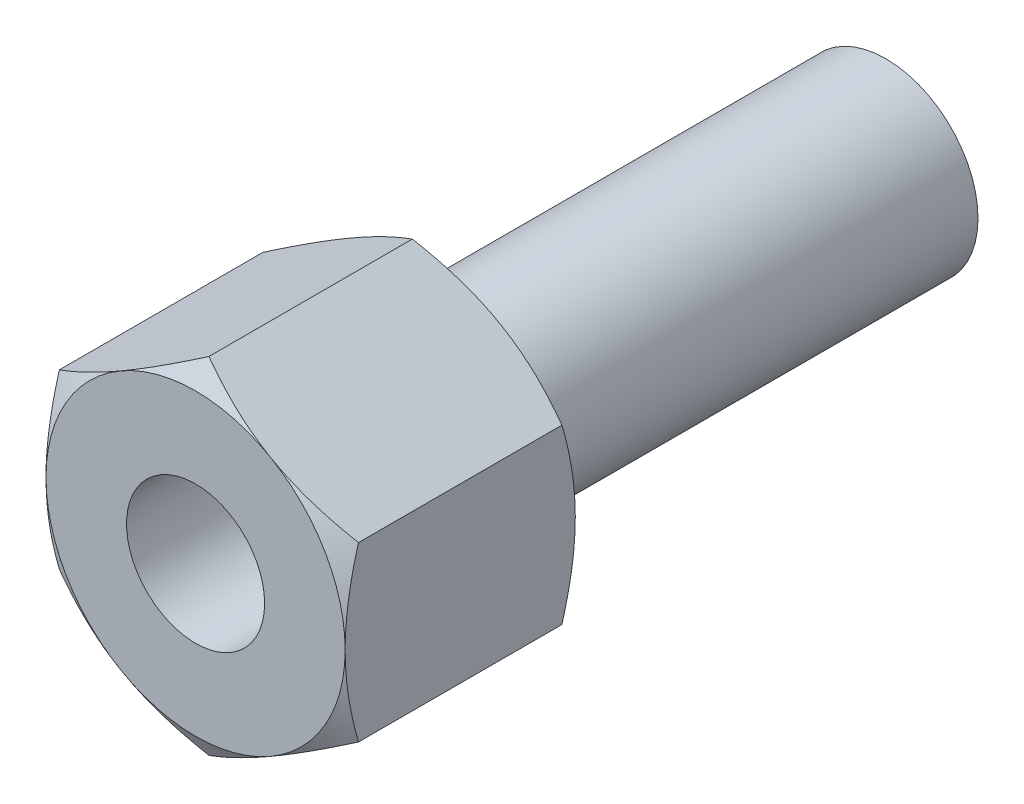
ISO-10303-21;
HEADER;
FILE_DESCRIPTION(('STEP AP214'),'2;1');
FILE_NAME('part.step','',(''),(''),'','','');
FILE_SCHEMA(('AUTOMOTIVE_DESIGN { 1 0 10303 214 1 1 1 1 }'));
ENDSEC;
DATA;
#1=APPLICATION_CONTEXT('core data for automotive mechanical design processes');
#2=APPLICATION_PROTOCOL_DEFINITION('international standard','automotive_design',2000,#1);
#3=PRODUCT_CONTEXT('',#1,'mechanical');
#4=PRODUCT('Part','Part','',(#3));
#5=PRODUCT_RELATED_PRODUCT_CATEGORY('part','',(#4));
#6=PRODUCT_DEFINITION_FORMATION('','',#4);
#7=PRODUCT_DEFINITION_CONTEXT('part definition',#1,'design');
#8=PRODUCT_DEFINITION('design','',#6,#7);
#9=PRODUCT_DEFINITION_SHAPE('','',#8);
#10=(LENGTH_UNIT() NAMED_UNIT(*) SI_UNIT(.MILLI.,.METRE.));
#11=(NAMED_UNIT(*) PLANE_ANGLE_UNIT() SI_UNIT($,.RADIAN.));
#12=(NAMED_UNIT(*) SI_UNIT($,.STERADIAN.) SOLID_ANGLE_UNIT());
#13=UNCERTAINTY_MEASURE_WITH_UNIT(LENGTH_MEASURE(1.E-05),#10,'distance_accuracy_value','');
#14=(GEOMETRIC_REPRESENTATION_CONTEXT(3) GLOBAL_UNCERTAINTY_ASSIGNED_CONTEXT((#13)) GLOBAL_UNIT_ASSIGNED_CONTEXT((#10,
#11,#12)) REPRESENTATION_CONTEXT('',''));
#15=CARTESIAN_POINT('',(0.,0.,0.));
#16=DIRECTION('',(0.,0.,1.));
#17=DIRECTION('',(1.,0.,0.));
#18=AXIS2_PLACEMENT_3D('',#15,#16,#17);
#19=CARTESIAN_POINT('',(-6.5,11.2583302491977,10.));
#20=DIRECTION('',(0.,0.,1.));
#21=DIRECTION('',(1.,0.,0.));
#22=AXIS2_PLACEMENT_3D('',#19,#20,#21);
#23=PLANE('',#22);
#24=CARTESIAN_POINT('',(0.,0.,10.));
#25=DIRECTION('',(0.,0.,1.));
#26=DIRECTION('',(1.,0.,0.));
#27=AXIS2_PLACEMENT_3D('',#24,#25,#26);
#28=CIRCLE('',#27,6.5);
#29=CARTESIAN_POINT('',(6.5,0.,10.));
#30=VERTEX_POINT('',#29);
#31=CARTESIAN_POINT('',(3.25,-5.62916512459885,10.));
#32=VERTEX_POINT('',#31);
#33=EDGE_CURVE('E322',#30,#32,#28,.F.);
#34=ORIENTED_EDGE('',*,*,#33,.F.);
#35=CARTESIAN_POINT('',(3.25,5.62916512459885,10.));
#36=VERTEX_POINT('',#35);
#37=EDGE_CURVE('E319',#36,#30,#28,.F.);
#38=ORIENTED_EDGE('',*,*,#37,.F.);
#39=CARTESIAN_POINT('',(-3.25,5.62916512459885,10.));
#40=VERTEX_POINT('',#39);
#41=EDGE_CURVE('E321',#40,#36,#28,.F.);
#42=ORIENTED_EDGE('',*,*,#41,.F.);
#43=CARTESIAN_POINT('',(0.,0.,10.));
#44=DIRECTION('',(0.,0.,-1.));
#45=DIRECTION('',(-1.,0.,0.));
#46=AXIS2_PLACEMENT_3D('',#43,#44,#45);
#47=CIRCLE('',#46,6.5);
#48=CARTESIAN_POINT('',(-6.5,0.,10.));
#49=VERTEX_POINT('',#48);
#50=EDGE_CURVE('E235',#49,#40,#47,.T.);
#51=ORIENTED_EDGE('',*,*,#50,.F.);
#52=CARTESIAN_POINT('',(-3.25,-5.62916512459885,10.));
#53=VERTEX_POINT('',#52);
#54=EDGE_CURVE('E325',#53,#49,#28,.F.);
#55=ORIENTED_EDGE('',*,*,#54,.F.);
#56=EDGE_CURVE('E327',#32,#53,#28,.F.);
#57=ORIENTED_EDGE('',*,*,#56,.F.);
#58=EDGE_LOOP('',(#34,#38,#42,#51,#55,#57));
#59=FACE_BOUND('',#58,.T.);
#60=CARTESIAN_POINT('',(0.,0.,10.));
#61=DIRECTION('',(0.,0.,1.));
#62=DIRECTION('',(1.,0.,0.));
#63=AXIS2_PLACEMENT_3D('',#60,#61,#62);
#64=CIRCLE('',#63,3.);
#65=CARTESIAN_POINT('',(3.,0.,10.));
#66=VERTEX_POINT('',#65);
#67=EDGE_CURVE('E299',#66,#66,#64,.T.);
#68=ORIENTED_EDGE('',*,*,#67,.F.);
#69=EDGE_LOOP('',(#68));
#70=FACE_BOUND('',#69,.T.);
#71=ADVANCED_FACE('F14',(#59,#70),#23,.T.);
#72=CARTESIAN_POINT('',(2.5,0.,4.));
#73=DIRECTION('',(0.,0.,-1.));
#74=DIRECTION('',(-1.,0.,0.));
#75=AXIS2_PLACEMENT_3D('',#72,#73,#74);
#76=PLANE('',#75);
#77=CARTESIAN_POINT('',(0.,0.,4.));
#78=DIRECTION('',(0.,0.,1.));
#79=DIRECTION('',(1.,0.,0.));
#80=AXIS2_PLACEMENT_3D('',#77,#78,#79);
#81=CIRCLE('',#80,3.);
#82=CARTESIAN_POINT('',(3.,0.,4.));
#83=VERTEX_POINT('',#82);
#84=EDGE_CURVE('E296',#83,#83,#81,.T.);
#85=ORIENTED_EDGE('',*,*,#84,.T.);
#86=EDGE_LOOP('',(#85));
#87=FACE_BOUND('',#86,.T.);
#88=ADVANCED_FACE('F194',(#87),#76,.F.);
#89=CARTESIAN_POINT('',(0.,0.,10.));
#90=DIRECTION('',(0.,0.,1.));
#91=DIRECTION('',(1.,0.,0.));
#92=AXIS2_PLACEMENT_3D('',#89,#90,#91);
#93=CYLINDRICAL_SURFACE('',#92,3.);
#94=ORIENTED_EDGE('',*,*,#84,.F.);
#95=EDGE_LOOP('',(#94));
#96=FACE_BOUND('',#95,.T.);
#97=ORIENTED_EDGE('',*,*,#67,.T.);
#98=EDGE_LOOP('',(#97));
#99=FACE_BOUND('',#98,.T.);
#100=ADVANCED_FACE('F280',(#96,#99),#93,.F.);
#101=CARTESIAN_POINT('',(0.,0.,10.));
#102=DIRECTION('',(0.,0.,-1.));
#103=DIRECTION('',(-1.,0.,0.));
#104=AXIS2_PLACEMENT_3D('',#101,#102,#103);
#105=CONICAL_SURFACE('',#104,6.5,1.0471975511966);
#106=ORIENTED_EDGE('',*,*,#37,.T.);
#107=CARTESIAN_POINT('',(6.5,-10.1219316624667,6.80767054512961));
#108=CARTESIAN_POINT('',(6.5,-9.83768979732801,6.94571973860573));
#109=CARTESIAN_POINT('',(6.5,-9.5527998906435,7.08245725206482));
#110=CARTESIAN_POINT('',(6.5,-8.98137955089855,7.35257206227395));
#111=CARTESIAN_POINT('',(6.5,-8.69484887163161,7.48594883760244));
#112=CARTESIAN_POINT('',(6.5,-8.11834601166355,7.74926750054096));
#113=CARTESIAN_POINT('',(6.5,-7.82836361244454,7.8791870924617));
#114=CARTESIAN_POINT('',(6.5,-7.24610694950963,8.13376497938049));
#115=CARTESIAN_POINT('',(6.5,-6.95383279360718,8.25842352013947));
#116=CARTESIAN_POINT('',(6.5,-6.35692091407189,8.5050613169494));
#117=CARTESIAN_POINT('',(6.5,-6.052191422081,8.62681967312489));
#118=CARTESIAN_POINT('',(6.5,-5.43918232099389,8.86122131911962));
#119=CARTESIAN_POINT('',(6.5,-5.13090232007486,8.97386359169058));
#120=CARTESIAN_POINT('',(6.5,-4.51086671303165,9.18710663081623));
#121=CARTESIAN_POINT('',(6.5,-4.19911945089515,9.28773142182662));
#122=CARTESIAN_POINT('',(6.5,-3.5711495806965,9.47373682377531));
#123=CARTESIAN_POINT('',(6.5,-3.25492840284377,9.55912219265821));
#124=CARTESIAN_POINT('',(6.5,-2.61961849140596,9.71012352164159));
#125=CARTESIAN_POINT('',(6.5,-2.30055613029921,9.77584867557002));
#126=CARTESIAN_POINT('',(6.5,-1.65837482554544,9.88383257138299));
#127=CARTESIAN_POINT('',(6.5,-1.33525628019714,9.92609359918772));
#128=CARTESIAN_POINT('',(6.5,-0.850972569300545,9.96908265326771));
#129=CARTESIAN_POINT('',(6.5,-0.690672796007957,9.98000539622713));
#130=CARTESIAN_POINT('',(6.5,-0.36974780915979,9.99506578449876));
#131=CARTESIAN_POINT('',(6.5,-0.209122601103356,9.99920354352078));
#132=CARTESIAN_POINT('',(6.5,0.112156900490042,10.0005876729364));
#133=CARTESIAN_POINT('',(6.5,0.272811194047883,9.99783403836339));
#134=CARTESIAN_POINT('',(6.5,0.593860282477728,9.985505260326));
#135=CARTESIAN_POINT('',(6.5,0.754255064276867,9.97592978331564));
#136=CARTESIAN_POINT('',(6.5,1.13848767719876,9.94502326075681));
#137=CARTESIAN_POINT('',(6.5,1.36207614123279,9.9205243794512));
#138=CARTESIAN_POINT('',(6.5,1.8076102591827,9.85959683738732));
#139=CARTESIAN_POINT('',(6.5,2.02955569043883,9.82316658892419));
#140=CARTESIAN_POINT('',(6.5,2.69266506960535,9.69790898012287));
#141=CARTESIAN_POINT('',(6.5,3.13085794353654,9.5931370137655));
#142=CARTESIAN_POINT('',(6.5,3.78610813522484,9.41124084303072));
#143=CARTESIAN_POINT('',(6.5,4.00655889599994,9.3456358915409));
#144=CARTESIAN_POINT('',(6.5,4.44531988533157,9.20755749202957));
#145=CARTESIAN_POINT('',(6.5,4.66363009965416,9.13508399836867));
#146=CARTESIAN_POINT('',(6.49999999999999,5.09817736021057,8.98443581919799));
#147=CARTESIAN_POINT('',(6.49999999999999,5.31441505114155,8.90626297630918));
#148=CARTESIAN_POINT('',(6.5,5.74509542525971,8.74514127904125));
#149=CARTESIAN_POINT('',(6.5,5.95953813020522,8.66219248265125));
#150=CARTESIAN_POINT('',(6.5,6.46830056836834,8.4599183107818));
#151=CARTESIAN_POINT('',(6.5,6.76189923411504,8.33878258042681));
#152=CARTESIAN_POINT('',(6.49999999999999,7.34656791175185,8.09053742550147));
#153=CARTESIAN_POINT('',(6.49999999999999,7.63763776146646,7.96342762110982));
#154=CARTESIAN_POINT('',(6.49999999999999,8.21771723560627,7.70444195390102));
#155=CARTESIAN_POINT('',(6.49999999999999,8.50672641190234,7.57256509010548));
#156=CARTESIAN_POINT('',(6.49999999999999,9.08298119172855,7.30500607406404));
#157=CARTESIAN_POINT('',(6.49999999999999,9.37022675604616,7.16932383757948));
#158=CARTESIAN_POINT('',(6.49999999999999,9.94355495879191,6.89472473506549));
#159=CARTESIAN_POINT('',(6.49999999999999,10.2296359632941,6.75580446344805));
#160=CARTESIAN_POINT('',(6.49999999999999,10.8005530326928,6.47542652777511));
#161=CARTESIAN_POINT('',(6.49999999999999,11.0853890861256,6.33396884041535));
#162=CARTESIAN_POINT('',(6.49999999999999,11.9382501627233,5.90650831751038));
#163=CARTESIAN_POINT('',(6.49999999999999,12.5047081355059,5.61737936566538));
#164=CARTESIAN_POINT('',(6.49999999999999,13.5866050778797,5.05808100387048));
#165=CARTESIAN_POINT('',(6.49999999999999,14.1022909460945,4.7883870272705));
#166=CARTESIAN_POINT('',(6.49999999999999,15.1317390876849,4.2453093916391));
#167=CARTESIAN_POINT('',(6.49999999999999,15.6455012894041,3.97192559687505));
#168=CARTESIAN_POINT('',(6.49999999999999,16.670208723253,3.42305759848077));
#169=CARTESIAN_POINT('',(6.49999999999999,17.1811577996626,3.1475805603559));
#170=CARTESIAN_POINT('',(6.49999999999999,18.2018275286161,2.59442810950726));
#171=CARTESIAN_POINT('',(6.49999999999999,18.7115482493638,2.31675282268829));
#172=CARTESIAN_POINT('',(6.5,19.2208178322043,2.03825814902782));
#173=B_SPLINE_CURVE_WITH_KNOTS('',3,(#107,#108,#109,#110,#111,#112,#113,#114,#115,#116,#117,
#118,#119,#120,#121,#122,#123,#124,#125,#126,#127,#128,#129,#130,#131,#132,#133,#134,#135,#136,
#137,#138,#139,#140,#141,#142,#143,#144,#145,#146,#147,#148,#149,#150,#151,#152,#153,#154,#155,
#156,#157,#158,#159,#160,#161,#162,#163,#164,#165,#166,#167,#168,#169,#170,#171,#172),
.UNSPECIFIED.,.F.,.F.,(4,2,2,2,2,2,2,2,2,2,2,2,2,2,2,2,2,2,2,2,2,2,2,2,2,2,2,2,2,2,2,2,4),(0.,
0.947987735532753,1.89612165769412,2.84934787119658,3.80252950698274,4.78687940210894,
5.77133898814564,6.75379634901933,7.73594643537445,8.71253575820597,9.68902992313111,
10.1709225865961,10.6528071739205,11.1346921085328,11.6166006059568,12.2910004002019,
12.9654899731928,14.3152013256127,15.0051594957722,15.6951222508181,16.3848629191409,
17.0745952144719,18.0273258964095,18.9801172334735,19.9331098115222,20.8861235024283,
21.8401892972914,22.7942638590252,24.7021463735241,26.4479829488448,28.1938839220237,
29.9353169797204,31.6766510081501),.UNSPECIFIED.);
#174=CARTESIAN_POINT('',(6.5,3.75277674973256,9.41944341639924));
#175=VERTEX_POINT('',#174);
#176=EDGE_CURVE('E222',#175,#30,#173,.F.);
#177=ORIENTED_EDGE('',*,*,#176,.F.);
#178=CARTESIAN_POINT('',(-0.000200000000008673,7.50566896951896,9.41937674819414));
#179=CARTESIAN_POINT('',(0.142677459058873,7.42317863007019,9.46699557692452));
#180=CARTESIAN_POINT('',(0.286087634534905,7.34038072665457,9.5124532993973));
#181=CARTESIAN_POINT('',(0.574072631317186,7.17411251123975,9.59845131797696));
#182=CARTESIAN_POINT('',(0.718647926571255,7.09064192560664,9.63898949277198));
#183=CARTESIAN_POINT('',(1.15468865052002,6.83889369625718,9.7524289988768));
#184=CARTESIAN_POINT('',(1.44787528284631,6.6696223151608,9.81695219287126));
#185=CARTESIAN_POINT('',(1.88662374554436,6.41631077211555,9.89261341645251));
#186=CARTESIAN_POINT('',(2.03087463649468,6.33302748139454,9.91416714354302));
#187=CARTESIAN_POINT('',(2.32002821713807,6.16608458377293,9.95030968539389));
#188=CARTESIAN_POINT('',(2.46493084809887,6.08242501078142,9.96489911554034));
#189=CARTESIAN_POINT('',(2.75498777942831,5.91496056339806,9.98674124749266));
#190=CARTESIAN_POINT('',(2.90014160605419,5.8311559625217,9.9940022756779));
#191=CARTESIAN_POINT('',(3.19057533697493,5.66347396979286,10.0010396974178));
#192=CARTESIAN_POINT('',(3.33585523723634,5.5795965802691,10.0008163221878));
#193=CARTESIAN_POINT('',(3.73387594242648,5.34979921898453,9.98991654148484));
#194=CARTESIAN_POINT('',(3.98648646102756,5.20395446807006,9.97161818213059));
#195=CARTESIAN_POINT('',(4.49002967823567,4.91323365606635,9.91359365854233));
#196=CARTESIAN_POINT('',(4.74096060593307,4.76835861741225,9.87384766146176));
#197=CARTESIAN_POINT('',(5.24551722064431,4.47705272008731,9.77449409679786));
#198=CARTESIAN_POINT('',(5.49907924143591,4.33065861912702,9.71446557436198));
#199=CARTESIAN_POINT('',(6.00242193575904,4.04005357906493,9.57822500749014));
#200=CARTESIAN_POINT('',(6.25220905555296,3.8958389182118,9.50204496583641));
#201=CARTESIAN_POINT('',(6.5002,3.75266127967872,9.41937674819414));
#202=B_SPLINE_CURVE_WITH_KNOTS('',3,(#178,#179,#180,#181,#182,#183,#184,#185,#186,#187,#188,
#189,#190,#191,#192,#193,#194,#195,#196,#197,#198,#199,#200,#201),.UNSPECIFIED.,.F.,.F.,(4,2,2,
2,2,2,2,2,2,2,2,4),(0.,0.515105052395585,1.03043143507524,2.06322554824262,2.56697389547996,
3.07067772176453,3.57380860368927,4.07692394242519,4.95279354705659,5.82947446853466,
6.72559912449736,7.61996451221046),.UNSPECIFIED.);
#203=EDGE_CURVE('E215',#36,#175,#202,.T.);
#204=ORIENTED_EDGE('',*,*,#203,.F.);
#205=EDGE_LOOP('',(#106,#177,#204));
#206=FACE_BOUND('',#205,.T.);
#207=ADVANCED_FACE('F282',(#206),#105,.T.);
#208=ORIENTED_EDGE('',*,*,#41,.T.);
#209=CARTESIAN_POINT('',(0.,7.50555349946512,9.41944341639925));
#210=VERTEX_POINT('',#209);
#211=EDGE_CURVE('E221',#210,#36,#202,.T.);
#212=ORIENTED_EDGE('',*,*,#211,.F.);
#213=CARTESIAN_POINT('',(-6.5002,3.75266127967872,9.41937674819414));
#214=CARTESIAN_POINT('',(-6.35732254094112,3.83515161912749,9.46699557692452));
#215=CARTESIAN_POINT('',(-6.21391236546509,3.91794952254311,9.5124532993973));
#216=CARTESIAN_POINT('',(-5.9259273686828,4.08421773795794,9.59845131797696));
#217=CARTESIAN_POINT('',(-5.78135207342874,4.16768832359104,9.63898949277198));
#218=CARTESIAN_POINT('',(-5.34531134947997,4.4194365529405,9.75242899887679));
#219=CARTESIAN_POINT('',(-5.05212471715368,4.58870793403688,9.81695219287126));
#220=CARTESIAN_POINT('',(-4.61337625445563,4.84201947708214,9.89261341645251));
#221=CARTESIAN_POINT('',(-4.46912536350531,4.92530276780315,9.91416714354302));
#222=CARTESIAN_POINT('',(-4.17997178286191,5.09224566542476,9.95030968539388));
#223=CARTESIAN_POINT('',(-4.03506915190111,5.17590523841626,9.96489911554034));
#224=CARTESIAN_POINT('',(-3.74501222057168,5.34336968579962,9.98674124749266));
#225=CARTESIAN_POINT('',(-3.59985839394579,5.42717428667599,9.9940022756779));
#226=CARTESIAN_POINT('',(-3.30942466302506,5.59485627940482,10.0010396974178));
#227=CARTESIAN_POINT('',(-3.16414476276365,5.67873366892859,10.0008163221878));
#228=CARTESIAN_POINT('',(-2.76612405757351,5.90853103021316,9.98991654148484));
#229=CARTESIAN_POINT('',(-2.51351353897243,6.05437578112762,9.97161818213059));
#230=CARTESIAN_POINT('',(-2.00997032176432,6.34509659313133,9.91359365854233));
#231=CARTESIAN_POINT('',(-1.75903939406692,6.48997163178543,9.87384766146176));
#232=CARTESIAN_POINT('',(-1.25448277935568,6.78127752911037,9.77449409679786));
#233=CARTESIAN_POINT('',(-1.00092075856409,6.92767163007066,9.71446557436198));
#234=CARTESIAN_POINT('',(-0.497578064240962,7.21827667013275,9.57822500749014));
#235=CARTESIAN_POINT('',(-0.247790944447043,7.36249133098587,9.50204496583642));
#236=CARTESIAN_POINT('',(0.000199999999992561,7.50566896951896,9.41937674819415));
#237=B_SPLINE_CURVE_WITH_KNOTS('',3,(#213,#214,#215,#216,#217,#218,#219,#220,#221,#222,#223,
#224,#225,#226,#227,#228,#229,#230,#231,#232,#233,#234,#235,#236),.UNSPECIFIED.,.F.,.F.,(4,2,2,
2,2,2,2,2,2,2,2,4),(0.,0.515105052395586,1.03043143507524,2.06322554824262,2.56697389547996,
3.07067772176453,3.57380860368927,4.07692394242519,4.95279354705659,5.82947446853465,
6.72559912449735,7.61996451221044),.UNSPECIFIED.);
#238=EDGE_CURVE('E175',#40,#210,#237,.T.);
#239=ORIENTED_EDGE('',*,*,#238,.F.);
#240=EDGE_LOOP('',(#208,#212,#239));
#241=FACE_BOUND('',#240,.T.);
#242=ADVANCED_FACE('F290',(#241),#105,.T.);
#243=ORIENTED_EDGE('',*,*,#50,.T.);
#244=CARTESIAN_POINT('',(-6.5,3.75277674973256,9.41944341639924));
#245=VERTEX_POINT('',#244);
#246=EDGE_CURVE('E174',#245,#40,#237,.T.);
#247=ORIENTED_EDGE('',*,*,#246,.F.);
#248=CARTESIAN_POINT('',(-6.5,-10.1219316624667,6.8076705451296));
#249=CARTESIAN_POINT('',(-6.5,-9.83768979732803,6.94571973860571));
#250=CARTESIAN_POINT('',(-6.50000000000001,-9.55279989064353,7.08245725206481));
#251=CARTESIAN_POINT('',(-6.50000000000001,-8.98137955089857,7.35257206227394));
#252=CARTESIAN_POINT('',(-6.50000000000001,-8.69484887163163,7.48594883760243));
#253=CARTESIAN_POINT('',(-6.50000000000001,-8.11834601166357,7.74926750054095));
#254=CARTESIAN_POINT('',(-6.50000000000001,-7.82836361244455,7.87918709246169));
#255=CARTESIAN_POINT('',(-6.50000000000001,-7.24610694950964,8.13376497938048));
#256=CARTESIAN_POINT('',(-6.50000000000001,-6.9538327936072,8.25842352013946));
#257=CARTESIAN_POINT('',(-6.50000000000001,-6.35692091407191,8.50506131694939));
#258=CARTESIAN_POINT('',(-6.5,-6.05219142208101,8.62681967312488));
#259=CARTESIAN_POINT('',(-6.5,-5.43918232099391,8.86122131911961));
#260=CARTESIAN_POINT('',(-6.5,-5.13090232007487,8.97386359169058));
#261=CARTESIAN_POINT('',(-6.5,-4.51086671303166,9.18710663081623));
#262=CARTESIAN_POINT('',(-6.5,-4.19911945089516,9.28773142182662));
#263=CARTESIAN_POINT('',(-6.5,-3.57114958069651,9.4737368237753));
#264=CARTESIAN_POINT('',(-6.5,-3.25492840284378,9.5591221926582));
#265=CARTESIAN_POINT('',(-6.5,-2.61961849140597,9.71012352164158));
#266=CARTESIAN_POINT('',(-6.5,-2.30055613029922,9.77584867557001));
#267=CARTESIAN_POINT('',(-6.5,-1.65837482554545,9.88383257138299));
#268=CARTESIAN_POINT('',(-6.5,-1.33525628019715,9.92609359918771));
#269=CARTESIAN_POINT('',(-6.5,-0.850972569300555,9.96908265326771));
#270=CARTESIAN_POINT('',(-6.5,-0.690672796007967,9.98000539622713));
#271=CARTESIAN_POINT('',(-6.5,-0.3697478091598,9.99506578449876));
#272=CARTESIAN_POINT('',(-6.5,-0.209122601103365,9.99920354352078));
#273=CARTESIAN_POINT('',(-6.5,0.112156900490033,10.0005876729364));
#274=CARTESIAN_POINT('',(-6.5,0.272811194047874,9.99783403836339));
#275=CARTESIAN_POINT('',(-6.5,0.59386028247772,9.98550526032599));
#276=CARTESIAN_POINT('',(-6.5,0.754255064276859,9.97592978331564));
#277=CARTESIAN_POINT('',(-6.5,1.13848767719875,9.94502326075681));
#278=CARTESIAN_POINT('',(-6.5,1.36207614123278,9.9205243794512));
#279=CARTESIAN_POINT('',(-6.5,1.80761025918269,9.85959683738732));
#280=CARTESIAN_POINT('',(-6.5,2.02955569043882,9.82316658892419));
#281=CARTESIAN_POINT('',(-6.5,2.69266506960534,9.69790898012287));
#282=CARTESIAN_POINT('',(-6.5,3.13085794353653,9.5931370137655));
#283=CARTESIAN_POINT('',(-6.5,3.78610813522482,9.41124084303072));
#284=CARTESIAN_POINT('',(-6.5,4.00655889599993,9.3456358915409));
#285=CARTESIAN_POINT('',(-6.5,4.44531988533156,9.20755749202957));
#286=CARTESIAN_POINT('',(-6.5,4.66363009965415,9.13508399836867));
#287=CARTESIAN_POINT('',(-6.5,5.09817736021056,8.98443581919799));
#288=CARTESIAN_POINT('',(-6.5,5.31441505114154,8.90626297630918));
#289=CARTESIAN_POINT('',(-6.5,5.7450954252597,8.74514127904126));
#290=CARTESIAN_POINT('',(-6.5,5.95953813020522,8.66219248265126));
#291=CARTESIAN_POINT('',(-6.5,6.46830056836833,8.45991831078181));
#292=CARTESIAN_POINT('',(-6.5,6.76189923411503,8.33878258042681));
#293=CARTESIAN_POINT('',(-6.5,7.34656791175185,8.09053742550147));
#294=CARTESIAN_POINT('',(-6.5,7.63763776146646,7.96342762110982));
#295=CARTESIAN_POINT('',(-6.5,8.21771723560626,7.70444195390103));
#296=CARTESIAN_POINT('',(-6.5,8.50672641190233,7.57256509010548));
#297=CARTESIAN_POINT('',(-6.5,9.08298119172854,7.30500607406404));
#298=CARTESIAN_POINT('',(-6.5,9.37022675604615,7.16932383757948));
#299=CARTESIAN_POINT('',(-6.5,9.94355495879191,6.89472473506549));
#300=CARTESIAN_POINT('',(-6.5,10.2296359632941,6.75580446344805));
#301=CARTESIAN_POINT('',(-6.5,10.8005530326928,6.47542652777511));
#302=CARTESIAN_POINT('',(-6.5,11.0853890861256,6.33396884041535));
#303=CARTESIAN_POINT('',(-6.5,11.9382501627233,5.90650831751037));
#304=CARTESIAN_POINT('',(-6.5,12.5047081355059,5.61737936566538));
#305=CARTESIAN_POINT('',(-6.5,13.5866050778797,5.05808100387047));
#306=CARTESIAN_POINT('',(-6.49999999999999,14.1022909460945,4.78838702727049));
#307=CARTESIAN_POINT('',(-6.49999999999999,15.1317390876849,4.2453093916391));
#308=CARTESIAN_POINT('',(-6.49999999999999,15.6455012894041,3.97192559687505));
#309=CARTESIAN_POINT('',(-6.49999999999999,16.670208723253,3.42305759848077));
#310=CARTESIAN_POINT('',(-6.49999999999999,17.1811577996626,3.1475805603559));
#311=CARTESIAN_POINT('',(-6.49999999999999,18.2018275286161,2.59442810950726));
#312=CARTESIAN_POINT('',(-6.5,18.7115482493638,2.31675282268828));
#313=CARTESIAN_POINT('',(-6.5,19.2208178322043,2.03825814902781));
#314=B_SPLINE_CURVE_WITH_KNOTS('',3,(#248,#249,#250,#251,#252,#253,#254,#255,#256,#257,#258,
#259,#260,#261,#262,#263,#264,#265,#266,#267,#268,#269,#270,#271,#272,#273,#274,#275,#276,#277,
#278,#279,#280,#281,#282,#283,#284,#285,#286,#287,#288,#289,#290,#291,#292,#293,#294,#295,#296,
#297,#298,#299,#300,#301,#302,#303,#304,#305,#306,#307,#308,#309,#310,#311,#312,#313),
.UNSPECIFIED.,.F.,.F.,(4,2,2,2,2,2,2,2,2,2,2,2,2,2,2,2,2,2,2,2,2,2,2,2,2,2,2,2,2,2,2,2,4),(0.,
0.947987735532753,1.89612165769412,2.84934787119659,3.80252950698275,4.78687940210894,
5.77133898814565,6.75379634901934,7.73594643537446,8.71253575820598,9.68902992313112,
10.1709225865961,10.6528071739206,11.1346921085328,11.6166006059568,12.2910004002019,
12.9654899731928,14.3152013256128,15.0051594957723,15.6951222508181,16.3848629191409,
17.0745952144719,18.0273258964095,18.9801172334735,19.9331098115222,20.8861235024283,
21.8401892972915,22.7942638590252,24.7021463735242,26.4479829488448,28.1938839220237,
29.9353169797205,31.6766510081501),.UNSPECIFIED.);
#315=EDGE_CURVE('E166',#49,#245,#314,.T.);
#316=ORIENTED_EDGE('',*,*,#315,.F.);
#317=EDGE_LOOP('',(#243,#247,#316));
#318=FACE_BOUND('',#317,.T.);
#319=ADVANCED_FACE('F438',(#318),#105,.T.);
#320=ORIENTED_EDGE('',*,*,#54,.T.);
#321=CARTESIAN_POINT('',(-6.5,-3.75277674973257,9.41944341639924));
#322=VERTEX_POINT('',#321);
#323=EDGE_CURVE('E173',#322,#49,#314,.T.);
#324=ORIENTED_EDGE('',*,*,#323,.F.);
#325=CARTESIAN_POINT('',(0.000200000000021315,-7.50566896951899,9.41937674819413));
#326=CARTESIAN_POINT('',(-0.142677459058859,-7.42317863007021,9.46699557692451));
#327=CARTESIAN_POINT('',(-0.286087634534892,-7.34038072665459,9.51245329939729));
#328=CARTESIAN_POINT('',(-0.574072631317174,-7.17411251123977,9.59845131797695));
#329=CARTESIAN_POINT('',(-0.718647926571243,-7.09064192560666,9.63898949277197));
#330=CARTESIAN_POINT('',(-1.15468865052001,-6.8388936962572,9.75242899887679));
#331=CARTESIAN_POINT('',(-1.4478752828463,-6.66962231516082,9.81695219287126));
#332=CARTESIAN_POINT('',(-1.88662374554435,-6.41631077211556,9.8926134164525));
#333=CARTESIAN_POINT('',(-2.03087463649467,-6.33302748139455,9.91416714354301));
#334=CARTESIAN_POINT('',(-2.32002821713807,-6.16608458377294,9.95030968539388));
#335=CARTESIAN_POINT('',(-2.46493084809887,-6.08242501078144,9.96489911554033));
#336=CARTESIAN_POINT('',(-2.7549877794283,-5.91496056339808,9.98674124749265));
#337=CARTESIAN_POINT('',(-2.90014160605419,-5.83115596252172,9.99400227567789));
#338=CARTESIAN_POINT('',(-3.19057533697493,-5.66347396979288,10.0010396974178));
#339=CARTESIAN_POINT('',(-3.33585523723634,-5.57959658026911,10.0008163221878));
#340=CARTESIAN_POINT('',(-3.73387594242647,-5.34979921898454,9.98991654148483));
#341=CARTESIAN_POINT('',(-3.98648646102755,-5.20395446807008,9.97161818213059));
#342=CARTESIAN_POINT('',(-4.49002967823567,-4.91323365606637,9.91359365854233));
#343=CARTESIAN_POINT('',(-4.74096060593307,-4.76835861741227,9.87384766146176));
#344=CARTESIAN_POINT('',(-5.24551722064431,-4.47705272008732,9.77449409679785));
#345=CARTESIAN_POINT('',(-5.49907924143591,-4.33065861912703,9.71446557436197));
#346=CARTESIAN_POINT('',(-6.00242193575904,-4.04005357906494,9.57822500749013));
#347=CARTESIAN_POINT('',(-6.25220905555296,-3.89583891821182,9.50204496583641));
#348=CARTESIAN_POINT('',(-6.5002,-3.75266127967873,9.41937674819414));
#349=B_SPLINE_CURVE_WITH_KNOTS('',3,(#325,#326,#327,#328,#329,#330,#331,#332,#333,#334,#335,
#336,#337,#338,#339,#340,#341,#342,#343,#344,#345,#346,#347,#348),.UNSPECIFIED.,.F.,.F.,(4,2,2,
2,2,2,2,2,2,2,2,4),(0.,0.515105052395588,1.03043143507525,2.06322554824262,2.56697389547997,
3.07067772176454,3.57380860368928,4.0769239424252,4.95279354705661,5.82947446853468,
6.72559912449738,7.61996451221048),.UNSPECIFIED.);
#350=EDGE_CURVE('E181',#53,#322,#349,.T.);
#351=ORIENTED_EDGE('',*,*,#350,.F.);
#352=EDGE_LOOP('',(#320,#324,#351));
#353=FACE_BOUND('',#352,.T.);
#354=ADVANCED_FACE('F192',(#353),#105,.T.);
#355=CARTESIAN_POINT('',(6.5002,-3.75266127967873,9.41937674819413));
#356=CARTESIAN_POINT('',(6.35732254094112,-3.83515161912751,9.46699557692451));
#357=CARTESIAN_POINT('',(6.21391236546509,-3.91794952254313,9.51245329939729));
#358=CARTESIAN_POINT('',(5.9259273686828,-4.08421773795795,9.59845131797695));
#359=CARTESIAN_POINT('',(5.78135207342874,-4.16768832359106,9.63898949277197));
#360=CARTESIAN_POINT('',(5.34531134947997,-4.41943655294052,9.75242899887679));
#361=CARTESIAN_POINT('',(5.05212471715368,-4.5887079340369,9.81695219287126));
#362=CARTESIAN_POINT('',(4.61337625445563,-4.84201947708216,9.89261341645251));
#363=CARTESIAN_POINT('',(4.46912536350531,-4.92530276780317,9.91416714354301));
#364=CARTESIAN_POINT('',(4.17997178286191,-5.09224566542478,9.95030968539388));
#365=CARTESIAN_POINT('',(4.03506915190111,-5.17590523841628,9.96489911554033));
#366=CARTESIAN_POINT('',(3.74501222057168,-5.34336968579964,9.98674124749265));
#367=CARTESIAN_POINT('',(3.59985839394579,-5.427174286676,9.99400227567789));
#368=CARTESIAN_POINT('',(3.30942466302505,-5.59485627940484,10.0010396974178));
#369=CARTESIAN_POINT('',(3.16414476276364,-5.67873366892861,10.0008163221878));
#370=CARTESIAN_POINT('',(2.76612405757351,-5.90853103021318,9.98991654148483));
#371=CARTESIAN_POINT('',(2.51351353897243,-6.05437578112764,9.97161818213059));
#372=CARTESIAN_POINT('',(2.00997032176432,-6.34509659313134,9.91359365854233));
#373=CARTESIAN_POINT('',(1.75903939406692,-6.48997163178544,9.87384766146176));
#374=CARTESIAN_POINT('',(1.25448277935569,-6.78127752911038,9.77449409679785));
#375=CARTESIAN_POINT('',(1.0009207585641,-6.92767163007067,9.71446557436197));
#376=CARTESIAN_POINT('',(0.497578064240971,-7.21827667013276,9.57822500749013));
#377=CARTESIAN_POINT('',(0.247790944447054,-7.36249133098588,9.50204496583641));
#378=CARTESIAN_POINT('',(-0.000199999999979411,-7.50566896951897,9.41937674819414));
#379=B_SPLINE_CURVE_WITH_KNOTS('',3,(#355,#356,#357,#358,#359,#360,#361,#362,#363,#364,#365,
#366,#367,#368,#369,#370,#371,#372,#373,#374,#375,#376,#377,#378),.UNSPECIFIED.,.F.,.F.,(4,2,2,
2,2,2,2,2,2,2,2,4),(0.,0.515105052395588,1.03043143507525,2.06322554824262,2.56697389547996,
3.07067772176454,3.57380860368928,4.0769239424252,4.9527935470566,5.82947446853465,
6.72559912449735,7.61996451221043),.UNSPECIFIED.);
#380=CARTESIAN_POINT('',(0.,-7.50555349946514,9.41944341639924));
#381=VERTEX_POINT('',#380);
#382=EDGE_CURVE('E199',#32,#381,#379,.T.);
#383=ORIENTED_EDGE('',*,*,#382,.F.);
#384=ORIENTED_EDGE('',*,*,#56,.T.);
#385=EDGE_CURVE('E339',#381,#53,#349,.T.);
#386=ORIENTED_EDGE('',*,*,#385,.F.);
#387=EDGE_LOOP('',(#383,#384,#386));
#388=FACE_BOUND('',#387,.T.);
#389=ADVANCED_FACE('F187',(#388),#105,.T.);
#390=ORIENTED_EDGE('',*,*,#33,.T.);
#391=CARTESIAN_POINT('',(6.5,-3.75277674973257,9.41944341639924));
#392=VERTEX_POINT('',#391);
#393=EDGE_CURVE('E230',#392,#32,#379,.T.);
#394=ORIENTED_EDGE('',*,*,#393,.F.);
#395=EDGE_CURVE('E208',#30,#392,#173,.F.);
#396=ORIENTED_EDGE('',*,*,#395,.F.);
#397=EDGE_LOOP('',(#390,#394,#396));
#398=FACE_BOUND('',#397,.T.);
#399=ADVANCED_FACE('F191',(#398),#105,.T.);
#400=CARTESIAN_POINT('',(0.,-7.50555349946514,10.));
#401=DIRECTION('',(-0.5,0.866025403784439,0.));
#402=DIRECTION('',(-0.866025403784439,-0.5,0.));
#403=AXIS2_PLACEMENT_3D('',#400,#401,#402);
#404=PLANE('',#403);
#405=DIRECTION('',(0.,0.,-1.));
#406=VECTOR('',#405,1.);
#407=CARTESIAN_POINT('',(0.,-7.50555349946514,10.));
#408=LINE('',#407,#406);
#409=CARTESIAN_POINT('',(0.,-7.50555349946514,0.580556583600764));
#410=VERTEX_POINT('',#409);
#411=EDGE_CURVE('E312',#381,#410,#408,.T.);
#412=ORIENTED_EDGE('',*,*,#411,.T.);
#413=CARTESIAN_POINT('',(-0.000199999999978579,-7.50566896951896,0.58062325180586));
#414=CARTESIAN_POINT('',(0.142677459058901,-7.42317863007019,0.533004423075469));
#415=CARTESIAN_POINT('',(0.286087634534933,-7.34038072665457,0.487546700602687));
#416=CARTESIAN_POINT('',(0.574072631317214,-7.17411251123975,0.401548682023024));
#417=CARTESIAN_POINT('',(0.718647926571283,-7.09064192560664,0.361010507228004));
#418=CARTESIAN_POINT('',(1.15468865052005,-6.83889369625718,0.24757100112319));
#419=CARTESIAN_POINT('',(1.44787528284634,-6.6696223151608,0.183047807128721));
#420=CARTESIAN_POINT('',(1.88662374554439,-6.41631077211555,0.107386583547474));
#421=CARTESIAN_POINT('',(2.0308746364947,-6.33302748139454,0.08583285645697));
#422=CARTESIAN_POINT('',(2.3200282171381,-6.16608458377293,0.0496903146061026));
#423=CARTESIAN_POINT('',(2.4649308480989,-6.08242501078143,0.0351008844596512));
#424=CARTESIAN_POINT('',(2.75498777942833,-5.91496056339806,0.0132587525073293));
#425=CARTESIAN_POINT('',(2.90014160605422,-5.8311559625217,0.00599772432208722));
#426=CARTESIAN_POINT('',(3.19057533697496,-5.66347396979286,-0.00103969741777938));
#427=CARTESIAN_POINT('',(3.33585523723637,-5.5795965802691,-0.000816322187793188));
#428=CARTESIAN_POINT('',(3.73387594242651,-5.34979921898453,0.0100834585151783));
#429=CARTESIAN_POINT('',(3.98648646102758,-5.20395446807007,0.0283818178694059));
#430=CARTESIAN_POINT('',(4.49002967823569,-4.91323365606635,0.0864063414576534));
#431=CARTESIAN_POINT('',(4.74096060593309,-4.76835861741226,0.126152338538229));
#432=CARTESIAN_POINT('',(5.24551722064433,-4.47705272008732,0.225505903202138));
#433=CARTESIAN_POINT('',(5.49907924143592,-4.33065861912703,0.285534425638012));
#434=CARTESIAN_POINT('',(6.00242193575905,-4.04005357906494,0.421774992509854));
#435=CARTESIAN_POINT('',(6.25220905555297,-3.89583891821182,0.497955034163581));
#436=CARTESIAN_POINT('',(6.5002,-3.75266127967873,0.580623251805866));
#437=B_SPLINE_CURVE_WITH_KNOTS('',3,(#413,#414,#415,#416,#417,#418,#419,#420,#421,#422,#423,
#424,#425,#426,#427,#428,#429,#430,#431,#432,#433,#434,#435,#436),.UNSPECIFIED.,.F.,.F.,(4,2,2,
2,2,2,2,2,2,2,2,4),(0.,0.515105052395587,1.03043143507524,2.06322554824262,2.56697389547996,
3.07067772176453,3.57380860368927,4.07692394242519,4.95279354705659,5.82947446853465,
6.72559912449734,7.61996451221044),.UNSPECIFIED.);
#438=CARTESIAN_POINT('',(3.25,-5.62916512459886,0.));
#439=VERTEX_POINT('',#438);
#440=EDGE_CURVE('E239',#410,#439,#437,.T.);
#441=ORIENTED_EDGE('',*,*,#440,.T.);
#442=CARTESIAN_POINT('',(6.5,-3.75277674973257,0.580556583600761));
#443=VERTEX_POINT('',#442);
#444=EDGE_CURVE('E244',#439,#443,#437,.T.);
#445=ORIENTED_EDGE('',*,*,#444,.T.);
#446=DIRECTION('',(0.,0.,-1.));
#447=VECTOR('',#446,1.);
#448=CARTESIAN_POINT('',(6.5,-3.75277674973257,10.));
#449=LINE('',#448,#447);
#450=EDGE_CURVE('E310',#392,#443,#449,.T.);
#451=ORIENTED_EDGE('',*,*,#450,.F.);
#452=ORIENTED_EDGE('',*,*,#393,.T.);
#453=ORIENTED_EDGE('',*,*,#382,.T.);
#454=EDGE_LOOP('',(#412,#441,#445,#451,#452,#453));
#455=FACE_BOUND('',#454,.T.);
#456=ADVANCED_FACE('F257',(#455),#404,.F.);
#457=CARTESIAN_POINT('',(6.5,-3.75277674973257,10.));
#458=DIRECTION('',(-1.,0.,0.));
#459=DIRECTION('',(0.,-1.,0.));
#460=AXIS2_PLACEMENT_3D('',#457,#458,#459);
#461=PLANE('',#460);
#462=ORIENTED_EDGE('',*,*,#450,.T.);
#463=CARTESIAN_POINT('',(6.5,-10.1219316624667,3.1923294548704));
#464=CARTESIAN_POINT('',(6.5,-9.83768979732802,3.05428026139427));
#465=CARTESIAN_POINT('',(6.5,-9.55279989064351,2.91754274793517));
#466=CARTESIAN_POINT('',(6.5,-8.98137955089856,2.64742793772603));
#467=CARTESIAN_POINT('',(6.5,-8.69484887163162,2.51405116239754));
#468=CARTESIAN_POINT('',(6.5,-8.11834601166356,2.25073249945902));
#469=CARTESIAN_POINT('',(6.5,-7.82836361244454,2.12081290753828));
#470=CARTESIAN_POINT('',(6.5,-7.24610694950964,1.8662350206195));
#471=CARTESIAN_POINT('',(6.5,-6.95383279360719,1.74157647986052));
#472=CARTESIAN_POINT('',(6.5,-6.3569209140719,1.49493868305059));
#473=CARTESIAN_POINT('',(6.5,-6.05219142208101,1.3731803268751));
#474=CARTESIAN_POINT('',(6.5,-5.4391823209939,1.13877868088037));
#475=CARTESIAN_POINT('',(6.5,-5.13090232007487,1.0261364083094));
#476=CARTESIAN_POINT('',(6.5,-4.51086671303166,0.812893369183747));
#477=CARTESIAN_POINT('',(6.5,-4.19911945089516,0.712268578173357));
#478=CARTESIAN_POINT('',(6.5,-3.5711495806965,0.526263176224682));
#479=CARTESIAN_POINT('',(6.5,-3.25492840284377,0.440877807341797));
#480=CARTESIAN_POINT('',(6.5,-2.61961849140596,0.289876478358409));
#481=CARTESIAN_POINT('',(6.5,-2.30055613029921,0.224151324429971));
#482=CARTESIAN_POINT('',(6.5,-1.65837482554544,0.116167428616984));
#483=CARTESIAN_POINT('',(6.5,-1.33525628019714,0.0739064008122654));
#484=CARTESIAN_POINT('',(6.5,-0.850972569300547,0.030917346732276));
#485=CARTESIAN_POINT('',(6.5,-0.690672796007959,0.0199946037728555));
#486=CARTESIAN_POINT('',(6.5,-0.369747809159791,0.00493421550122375));
#487=CARTESIAN_POINT('',(6.5,-0.209122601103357,0.000796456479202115));
#488=CARTESIAN_POINT('',(6.5,0.112156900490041,-0.000587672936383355));
#489=CARTESIAN_POINT('',(6.5,0.272811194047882,0.00216596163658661));
#490=CARTESIAN_POINT('',(6.5,0.593860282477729,0.0144947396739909));
#491=CARTESIAN_POINT('',(6.5,0.754255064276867,0.0240702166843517));
#492=CARTESIAN_POINT('',(6.5,1.13848767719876,0.0549767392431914));
#493=CARTESIAN_POINT('',(6.5,1.36207614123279,0.0794756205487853));
#494=CARTESIAN_POINT('',(6.5,1.80761025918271,0.140403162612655));
#495=CARTESIAN_POINT('',(6.5,2.02955569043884,0.176833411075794));
#496=CARTESIAN_POINT('',(6.5,2.69266506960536,0.302091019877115));
#497=CARTESIAN_POINT('',(6.5,3.13085794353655,0.406862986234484));
#498=CARTESIAN_POINT('',(6.5,3.78610813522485,0.588759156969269));
#499=CARTESIAN_POINT('',(6.5,4.00655889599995,0.654364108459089));
#500=CARTESIAN_POINT('',(6.5,4.44531988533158,0.792442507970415));
#501=CARTESIAN_POINT('',(6.5,4.66363009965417,0.864916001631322));
#502=CARTESIAN_POINT('',(6.49999999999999,5.09817736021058,1.015564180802));
#503=CARTESIAN_POINT('',(6.49999999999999,5.31441505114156,1.0937370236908));
#504=CARTESIAN_POINT('',(6.5,5.74509542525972,1.25485872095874));
#505=CARTESIAN_POINT('',(6.5,5.95953813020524,1.33780751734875));
#506=CARTESIAN_POINT('',(6.5,6.46830056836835,1.54008168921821));
#507=CARTESIAN_POINT('',(6.5,6.76189923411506,1.66121741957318));
#508=CARTESIAN_POINT('',(6.49999999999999,7.34656791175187,1.90946257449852));
#509=CARTESIAN_POINT('',(6.49999999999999,7.63763776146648,2.03657237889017));
#510=CARTESIAN_POINT('',(6.49999999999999,8.21771723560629,2.29555804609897));
#511=CARTESIAN_POINT('',(6.49999999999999,8.50672641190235,2.42743490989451));
#512=CARTESIAN_POINT('',(6.49999999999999,9.08298119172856,2.69499392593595));
#513=CARTESIAN_POINT('',(6.49999999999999,9.37022675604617,2.83067616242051));
#514=CARTESIAN_POINT('',(6.49999999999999,9.94355495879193,3.1052752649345));
#515=CARTESIAN_POINT('',(6.49999999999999,10.2296359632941,3.24419553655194));
#516=CARTESIAN_POINT('',(6.49999999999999,10.8005530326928,3.52457347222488));
#517=CARTESIAN_POINT('',(6.49999999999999,11.0853890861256,3.66603115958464));
#518=CARTESIAN_POINT('',(6.49999999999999,11.9382501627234,4.09349168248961));
#519=CARTESIAN_POINT('',(6.49999999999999,12.5047081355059,4.38262063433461));
#520=CARTESIAN_POINT('',(6.49999999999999,13.5866050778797,4.94191899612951));
#521=CARTESIAN_POINT('',(6.49999999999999,14.1022909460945,5.21161297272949));
#522=CARTESIAN_POINT('',(6.49999999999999,15.1317390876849,5.75469060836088));
#523=CARTESIAN_POINT('',(6.49999999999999,15.6455012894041,6.02807440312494));
#524=CARTESIAN_POINT('',(6.49999999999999,16.670208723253,6.57694240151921));
#525=CARTESIAN_POINT('',(6.49999999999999,17.1811577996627,6.85241943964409));
#526=CARTESIAN_POINT('',(6.49999999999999,18.2018275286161,7.40557189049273));
#527=CARTESIAN_POINT('',(6.49999999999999,18.7115482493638,7.68324717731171));
#528=CARTESIAN_POINT('',(6.5,19.2208178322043,7.96174185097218));
#529=B_SPLINE_CURVE_WITH_KNOTS('',3,(#463,#464,#465,#466,#467,#468,#469,#470,#471,#472,#473,
#474,#475,#476,#477,#478,#479,#480,#481,#482,#483,#484,#485,#486,#487,#488,#489,#490,#491,#492,
#493,#494,#495,#496,#497,#498,#499,#500,#501,#502,#503,#504,#505,#506,#507,#508,#509,#510,#511,
#512,#513,#514,#515,#516,#517,#518,#519,#520,#521,#522,#523,#524,#525,#526,#527,#528),
.UNSPECIFIED.,.F.,.F.,(4,2,2,2,2,2,2,2,2,2,2,2,2,2,2,2,2,2,2,2,2,2,2,2,2,2,2,2,2,2,2,2,4),(0.,
0.947987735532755,1.89612165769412,2.84934787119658,3.80252950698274,4.78687940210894,
5.77133898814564,6.75379634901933,7.73594643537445,8.71253575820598,9.68902992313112,
10.1709225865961,10.6528071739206,11.1346921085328,11.6166006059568,12.2910004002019,
12.9654899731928,14.3152013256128,15.0051594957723,15.6951222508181,16.384862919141,
17.074595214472,18.0273258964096,18.9801172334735,19.9331098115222,20.8861235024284,
21.8401892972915,22.7942638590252,24.7021463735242,26.4479829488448,28.1938839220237,
29.9353169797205,31.6766510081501),.UNSPECIFIED.);
#530=CARTESIAN_POINT('',(6.5,0.,0.));
#531=VERTEX_POINT('',#530);
#532=EDGE_CURVE('E44',#443,#531,#529,.T.);
#533=ORIENTED_EDGE('',*,*,#532,.T.);
#534=CARTESIAN_POINT('',(6.5,3.75277674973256,0.580556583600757));
#535=VERTEX_POINT('',#534);
#536=EDGE_CURVE('E252',#531,#535,#529,.T.);
#537=ORIENTED_EDGE('',*,*,#536,.T.);
#538=DIRECTION('',(0.,0.,-1.));
#539=VECTOR('',#538,1.);
#540=CARTESIAN_POINT('',(6.5,3.75277674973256,10.));
#541=LINE('',#540,#539);
#542=EDGE_CURVE('E303',#175,#535,#541,.T.);
#543=ORIENTED_EDGE('',*,*,#542,.F.);
#544=ORIENTED_EDGE('',*,*,#176,.T.);
#545=ORIENTED_EDGE('',*,*,#395,.T.);
#546=EDGE_LOOP('',(#462,#533,#537,#543,#544,#545));
#547=FACE_BOUND('',#546,.T.);
#548=ADVANCED_FACE('F260',(#547),#461,.F.);
#549=CARTESIAN_POINT('',(6.5,3.75277674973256,10.));
#550=DIRECTION('',(-0.5,-0.866025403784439,0.));
#551=DIRECTION('',(0.866025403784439,-0.5,0.));
#552=AXIS2_PLACEMENT_3D('',#549,#550,#551);
#553=PLANE('',#552);
#554=ORIENTED_EDGE('',*,*,#542,.T.);
#555=CARTESIAN_POINT('',(6.5002,3.75266127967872,0.580623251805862));
#556=CARTESIAN_POINT('',(6.35732254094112,3.83515161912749,0.533004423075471));
#557=CARTESIAN_POINT('',(6.21391236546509,3.91794952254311,0.487546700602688));
#558=CARTESIAN_POINT('',(5.92592736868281,4.08421773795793,0.401548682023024));
#559=CARTESIAN_POINT('',(5.78135207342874,4.16768832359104,0.361010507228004));
#560=CARTESIAN_POINT('',(5.34531134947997,4.4194365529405,0.247571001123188));
#561=CARTESIAN_POINT('',(5.05212471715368,4.58870793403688,0.183047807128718));
#562=CARTESIAN_POINT('',(4.61337625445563,4.84201947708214,0.107386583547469));
#563=CARTESIAN_POINT('',(4.46912536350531,4.92530276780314,0.0858328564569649));
#564=CARTESIAN_POINT('',(4.17997178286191,5.09224566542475,0.0496903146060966));
#565=CARTESIAN_POINT('',(4.03506915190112,5.17590523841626,0.0351008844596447));
#566=CARTESIAN_POINT('',(3.74501222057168,5.34336968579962,0.013258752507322));
#567=CARTESIAN_POINT('',(3.59985839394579,5.42717428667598,0.00599772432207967));
#568=CARTESIAN_POINT('',(3.30942466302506,5.59485627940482,-0.00103969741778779));
#569=CARTESIAN_POINT('',(3.16414476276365,5.67873366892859,-0.000816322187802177));
#570=CARTESIAN_POINT('',(2.76612405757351,5.90853103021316,0.0100834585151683));
#571=CARTESIAN_POINT('',(2.51351353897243,6.05437578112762,0.0283818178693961));
#572=CARTESIAN_POINT('',(2.00997032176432,6.34509659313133,0.0864063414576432));
#573=CARTESIAN_POINT('',(1.75903939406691,6.48997163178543,0.126152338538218));
#574=CARTESIAN_POINT('',(1.25448277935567,6.78127752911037,0.225505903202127));
#575=CARTESIAN_POINT('',(1.00092075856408,6.92767163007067,0.285534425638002));
#576=CARTESIAN_POINT('',(0.497578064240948,7.21827667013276,0.421774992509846));
#577=CARTESIAN_POINT('',(0.247790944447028,7.36249133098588,0.497955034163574));
#578=CARTESIAN_POINT('',(-0.000200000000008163,7.50566896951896,0.58062325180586));
#579=B_SPLINE_CURVE_WITH_KNOTS('',3,(#555,#556,#557,#558,#559,#560,#561,#562,#563,#564,#565,
#566,#567,#568,#569,#570,#571,#572,#573,#574,#575,#576,#577,#578),.UNSPECIFIED.,.F.,.F.,(4,2,2,
2,2,2,2,2,2,2,2,4),(0.,0.515105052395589,1.03043143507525,2.06322554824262,2.56697389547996,
3.07067772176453,3.57380860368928,4.0769239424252,4.95279354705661,5.82947446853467,
6.72559912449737,7.61996451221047),.UNSPECIFIED.);
#580=CARTESIAN_POINT('',(3.25,5.62916512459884,0.));
#581=VERTEX_POINT('',#580);
#582=EDGE_CURVE('E356',#535,#581,#579,.T.);
#583=ORIENTED_EDGE('',*,*,#582,.T.);
#584=CARTESIAN_POINT('',(0.,7.50555349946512,0.580556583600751));
#585=VERTEX_POINT('',#584);
#586=EDGE_CURVE('E353',#581,#585,#579,.T.);
#587=ORIENTED_EDGE('',*,*,#586,.T.);
#588=DIRECTION('',(0.,0.,-1.));
#589=VECTOR('',#588,1.);
#590=CARTESIAN_POINT('',(0.,7.50555349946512,10.));
#591=LINE('',#590,#589);
#592=EDGE_CURVE('E317',#210,#585,#591,.T.);
#593=ORIENTED_EDGE('',*,*,#592,.F.);
#594=ORIENTED_EDGE('',*,*,#211,.T.);
#595=ORIENTED_EDGE('',*,*,#203,.T.);
#596=EDGE_LOOP('',(#554,#583,#587,#593,#594,#595));
#597=FACE_BOUND('',#596,.T.);
#598=ADVANCED_FACE('F16',(#597),#553,.F.);
#599=CARTESIAN_POINT('',(0.,7.50555349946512,10.));
#600=DIRECTION('',(0.5,-0.866025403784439,0.));
#601=DIRECTION('',(0.866025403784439,0.5,0.));
#602=AXIS2_PLACEMENT_3D('',#599,#600,#601);
#603=PLANE('',#602);
#604=ORIENTED_EDGE('',*,*,#592,.T.);
#605=CARTESIAN_POINT('',(0.000199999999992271,7.50566896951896,0.580623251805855));
#606=CARTESIAN_POINT('',(-0.142677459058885,7.42317863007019,0.533004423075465));
#607=CARTESIAN_POINT('',(-0.286087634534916,7.34038072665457,0.487546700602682));
#608=CARTESIAN_POINT('',(-0.574072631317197,7.17411251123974,0.40154868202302));
#609=CARTESIAN_POINT('',(-0.718647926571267,7.09064192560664,0.361010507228));
#610=CARTESIAN_POINT('',(-1.15468865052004,6.83889369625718,0.247571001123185));
#611=CARTESIAN_POINT('',(-1.44787528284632,6.66962231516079,0.183047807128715));
#612=CARTESIAN_POINT('',(-1.88662374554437,6.41631077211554,0.107386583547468));
#613=CARTESIAN_POINT('',(-2.03087463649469,6.33302748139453,0.0858328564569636));
#614=CARTESIAN_POINT('',(-2.32002821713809,6.16608458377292,0.049690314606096));
#615=CARTESIAN_POINT('',(-2.46493084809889,6.08242501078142,0.0351008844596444));
#616=CARTESIAN_POINT('',(-2.75498777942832,5.91496056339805,0.0132587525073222));
#617=CARTESIAN_POINT('',(-2.90014160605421,5.83115596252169,0.00599772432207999));
#618=CARTESIAN_POINT('',(-3.19057533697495,5.66347396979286,-0.00103969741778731));
#619=CARTESIAN_POINT('',(-3.33585523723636,5.57959658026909,-0.00081632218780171));
#620=CARTESIAN_POINT('',(-3.73387594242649,5.34979921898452,0.0100834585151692));
#621=CARTESIAN_POINT('',(-3.98648646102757,5.20395446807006,0.0283818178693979));
#622=CARTESIAN_POINT('',(-4.49002967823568,4.91323365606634,0.0864063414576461));
#623=CARTESIAN_POINT('',(-4.74096060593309,4.76835861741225,0.126152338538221));
#624=CARTESIAN_POINT('',(-5.24551722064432,4.4770527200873,0.22550590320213));
#625=CARTESIAN_POINT('',(-5.49907924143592,4.33065861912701,0.285534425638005));
#626=CARTESIAN_POINT('',(-6.00242193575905,4.04005357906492,0.421774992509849));
#627=CARTESIAN_POINT('',(-6.25220905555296,3.8958389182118,0.497955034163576));
#628=CARTESIAN_POINT('',(-6.5002,3.75266127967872,0.580623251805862));
#629=B_SPLINE_CURVE_WITH_KNOTS('',3,(#605,#606,#607,#608,#609,#610,#611,#612,#613,#614,#615,
#616,#617,#618,#619,#620,#621,#622,#623,#624,#625,#626,#627,#628),.UNSPECIFIED.,.F.,.F.,(4,2,2,
2,2,2,2,2,2,2,2,4),(0.,0.515105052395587,1.03043143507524,2.06322554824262,2.56697389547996,
3.07067772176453,3.57380860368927,4.07692394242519,4.9527935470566,5.82947446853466,
6.72559912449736,7.61996451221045),.UNSPECIFIED.);
#630=CARTESIAN_POINT('',(-3.25,5.62916512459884,0.));
#631=VERTEX_POINT('',#630);
#632=EDGE_CURVE('E351',#585,#631,#629,.T.);
#633=ORIENTED_EDGE('',*,*,#632,.T.);
#634=CARTESIAN_POINT('',(-6.5,3.75277674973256,0.58055658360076));
#635=VERTEX_POINT('',#634);
#636=EDGE_CURVE('E118',#631,#635,#629,.T.);
#637=ORIENTED_EDGE('',*,*,#636,.T.);
#638=DIRECTION('',(0.,0.,-1.));
#639=VECTOR('',#638,1.);
#640=CARTESIAN_POINT('',(-6.5,3.75277674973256,10.));
#641=LINE('',#640,#639);
#642=EDGE_CURVE('E138',#245,#635,#641,.T.);
#643=ORIENTED_EDGE('',*,*,#642,.F.);
#644=ORIENTED_EDGE('',*,*,#246,.T.);
#645=ORIENTED_EDGE('',*,*,#238,.T.);
#646=EDGE_LOOP('',(#604,#633,#637,#643,#644,#645));
#647=FACE_BOUND('',#646,.T.);
#648=ADVANCED_FACE('F160',(#647),#603,.F.);
#649=CARTESIAN_POINT('',(-6.5,3.75277674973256,10.));
#650=DIRECTION('',(1.,0.,0.));
#651=DIRECTION('',(0.,1.,0.));
#652=AXIS2_PLACEMENT_3D('',#649,#650,#651);
#653=PLANE('',#652);
#654=ORIENTED_EDGE('',*,*,#642,.T.);
#655=CARTESIAN_POINT('',(-6.5,-10.1219316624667,3.1923294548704));
#656=CARTESIAN_POINT('',(-6.5,-9.83768979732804,3.05428026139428));
#657=CARTESIAN_POINT('',(-6.50000000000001,-9.55279989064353,2.91754274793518));
#658=CARTESIAN_POINT('',(-6.50000000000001,-8.98137955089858,2.64742793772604));
#659=CARTESIAN_POINT('',(-6.50000000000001,-8.69484887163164,2.51405116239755));
#660=CARTESIAN_POINT('',(-6.50000000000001,-8.11834601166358,2.25073249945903));
#661=CARTESIAN_POINT('',(-6.50000000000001,-7.82836361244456,2.12081290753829));
#662=CARTESIAN_POINT('',(-6.50000000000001,-7.24610694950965,1.86623502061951));
#663=CARTESIAN_POINT('',(-6.50000000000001,-6.95383279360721,1.74157647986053));
#664=CARTESIAN_POINT('',(-6.50000000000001,-6.35692091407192,1.4949386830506));
#665=CARTESIAN_POINT('',(-6.5,-6.05219142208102,1.3731803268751));
#666=CARTESIAN_POINT('',(-6.5,-5.43918232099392,1.13877868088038));
#667=CARTESIAN_POINT('',(-6.5,-5.13090232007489,1.02613640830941));
#668=CARTESIAN_POINT('',(-6.5,-4.51086671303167,0.812893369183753));
#669=CARTESIAN_POINT('',(-6.5,-4.19911945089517,0.712268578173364));
#670=CARTESIAN_POINT('',(-6.5,-3.57114958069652,0.526263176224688));
#671=CARTESIAN_POINT('',(-6.5,-3.25492840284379,0.440877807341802));
#672=CARTESIAN_POINT('',(-6.5,-2.61961849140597,0.289876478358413));
#673=CARTESIAN_POINT('',(-6.5,-2.30055613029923,0.224151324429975));
#674=CARTESIAN_POINT('',(-6.5,-1.65837482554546,0.116167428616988));
#675=CARTESIAN_POINT('',(-6.5,-1.33525628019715,0.0739064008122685));
#676=CARTESIAN_POINT('',(-6.5,-0.850972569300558,0.0309173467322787));
#677=CARTESIAN_POINT('',(-6.5,-0.69067279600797,0.019994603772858));
#678=CARTESIAN_POINT('',(-6.5,-0.369747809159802,0.004934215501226));
#679=CARTESIAN_POINT('',(-6.5,-0.209122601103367,0.000796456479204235));
#680=CARTESIAN_POINT('',(-6.5,0.112156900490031,-0.000587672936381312));
#681=CARTESIAN_POINT('',(-6.5,0.272811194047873,0.00216596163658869));
#682=CARTESIAN_POINT('',(-6.5,0.59386028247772,0.0144947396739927));
#683=CARTESIAN_POINT('',(-6.5,0.754255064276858,0.0240702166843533));
#684=CARTESIAN_POINT('',(-6.5,1.13848767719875,0.0549767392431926));
#685=CARTESIAN_POINT('',(-6.5,1.36207614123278,0.0794756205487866));
#686=CARTESIAN_POINT('',(-6.5,1.8076102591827,0.140403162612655));
#687=CARTESIAN_POINT('',(-6.5,2.02955569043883,0.176833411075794));
#688=CARTESIAN_POINT('',(-6.5,2.69266506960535,0.302091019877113));
#689=CARTESIAN_POINT('',(-6.5,3.13085794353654,0.406862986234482));
#690=CARTESIAN_POINT('',(-6.5,3.78610813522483,0.588759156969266));
#691=CARTESIAN_POINT('',(-6.5,4.00655889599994,0.654364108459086));
#692=CARTESIAN_POINT('',(-6.5,4.44531988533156,0.792442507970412));
#693=CARTESIAN_POINT('',(-6.5,4.66363009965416,0.864916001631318));
#694=CARTESIAN_POINT('',(-6.5,5.09817736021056,1.01556418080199));
#695=CARTESIAN_POINT('',(-6.5,5.31441505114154,1.0937370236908));
#696=CARTESIAN_POINT('',(-6.5,5.74509542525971,1.25485872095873));
#697=CARTESIAN_POINT('',(-6.5,5.95953813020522,1.33780751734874));
#698=CARTESIAN_POINT('',(-6.5,6.46830056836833,1.5400816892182));
#699=CARTESIAN_POINT('',(-6.5,6.76189923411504,1.66121741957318));
#700=CARTESIAN_POINT('',(-6.5,7.34656791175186,1.90946257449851));
#701=CARTESIAN_POINT('',(-6.5,7.63763776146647,2.03657237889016));
#702=CARTESIAN_POINT('',(-6.5,8.21771723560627,2.29555804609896));
#703=CARTESIAN_POINT('',(-6.5,8.50672641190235,2.42743490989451));
#704=CARTESIAN_POINT('',(-6.5,9.08298119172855,2.69499392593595));
#705=CARTESIAN_POINT('',(-6.5,9.37022675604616,2.83067616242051));
#706=CARTESIAN_POINT('',(-6.5,9.94355495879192,3.1052752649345));
#707=CARTESIAN_POINT('',(-6.5,10.2296359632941,3.24419553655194));
#708=CARTESIAN_POINT('',(-6.5,10.8005530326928,3.52457347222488));
#709=CARTESIAN_POINT('',(-6.5,11.0853890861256,3.66603115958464));
#710=CARTESIAN_POINT('',(-6.5,11.9382501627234,4.09349168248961));
#711=CARTESIAN_POINT('',(-6.5,12.5047081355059,4.38262063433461));
#712=CARTESIAN_POINT('',(-6.5,13.5866050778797,4.94191899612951));
#713=CARTESIAN_POINT('',(-6.49999999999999,14.1022909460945,5.21161297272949));
#714=CARTESIAN_POINT('',(-6.49999999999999,15.1317390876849,5.75469060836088));
#715=CARTESIAN_POINT('',(-6.49999999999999,15.6455012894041,6.02807440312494));
#716=CARTESIAN_POINT('',(-6.49999999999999,16.670208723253,6.57694240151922));
#717=CARTESIAN_POINT('',(-6.49999999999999,17.1811577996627,6.85241943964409));
#718=CARTESIAN_POINT('',(-6.49999999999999,18.2018275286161,7.40557189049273));
#719=CARTESIAN_POINT('',(-6.5,18.7115482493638,7.68324717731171));
#720=CARTESIAN_POINT('',(-6.5,19.2208178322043,7.96174185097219));
#721=B_SPLINE_CURVE_WITH_KNOTS('',3,(#655,#656,#657,#658,#659,#660,#661,#662,#663,#664,#665,
#666,#667,#668,#669,#670,#671,#672,#673,#674,#675,#676,#677,#678,#679,#680,#681,#682,#683,#684,
#685,#686,#687,#688,#689,#690,#691,#692,#693,#694,#695,#696,#697,#698,#699,#700,#701,#702,#703,
#704,#705,#706,#707,#708,#709,#710,#711,#712,#713,#714,#715,#716,#717,#718,#719,#720),
.UNSPECIFIED.,.F.,.F.,(4,2,2,2,2,2,2,2,2,2,2,2,2,2,2,2,2,2,2,2,2,2,2,2,2,2,2,2,2,2,2,2,4),(0.,
0.947987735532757,1.89612165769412,2.84934787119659,3.80252950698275,4.78687940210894,
5.77133898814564,6.75379634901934,7.73594643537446,8.71253575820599,9.68902992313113,
10.1709225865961,10.6528071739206,11.1346921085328,11.6166006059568,12.2910004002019,
12.9654899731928,14.3152013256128,15.0051594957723,15.6951222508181,16.384862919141,
17.074595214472,18.0273258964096,18.9801172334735,19.9331098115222,20.8861235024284,
21.8401892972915,22.7942638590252,24.7021463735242,26.4479829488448,28.1938839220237,
29.9353169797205,31.6766510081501),.UNSPECIFIED.);
#722=CARTESIAN_POINT('',(-6.5,0.,0.));
#723=VERTEX_POINT('',#722);
#724=EDGE_CURVE('E116',#635,#723,#721,.F.);
#725=ORIENTED_EDGE('',*,*,#724,.T.);
#726=CARTESIAN_POINT('',(-6.5,-3.75277674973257,0.580556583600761));
#727=VERTEX_POINT('',#726);
#728=EDGE_CURVE('E123',#723,#727,#721,.F.);
#729=ORIENTED_EDGE('',*,*,#728,.T.);
#730=DIRECTION('',(0.,0.,-1.));
#731=VECTOR('',#730,1.);
#732=CARTESIAN_POINT('',(-6.5,-3.75277674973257,10.));
#733=LINE('',#732,#731);
#734=EDGE_CURVE('E314',#322,#727,#733,.T.);
#735=ORIENTED_EDGE('',*,*,#734,.F.);
#736=ORIENTED_EDGE('',*,*,#323,.T.);
#737=ORIENTED_EDGE('',*,*,#315,.T.);
#738=EDGE_LOOP('',(#654,#725,#729,#735,#736,#737));
#739=FACE_BOUND('',#738,.T.);
#740=ADVANCED_FACE('F135',(#739),#653,.F.);
#741=CARTESIAN_POINT('',(-6.5,-3.75277674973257,10.));
#742=DIRECTION('',(0.5,0.866025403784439,0.));
#743=DIRECTION('',(-0.866025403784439,0.5,0.));
#744=AXIS2_PLACEMENT_3D('',#741,#742,#743);
#745=PLANE('',#744);
#746=ORIENTED_EDGE('',*,*,#734,.T.);
#747=CARTESIAN_POINT('',(-6.5002,-3.75266127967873,0.580623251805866));
#748=CARTESIAN_POINT('',(-6.35732254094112,-3.83515161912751,0.533004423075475));
#749=CARTESIAN_POINT('',(-6.21391236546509,-3.91794952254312,0.487546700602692));
#750=CARTESIAN_POINT('',(-5.92592736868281,-4.08421773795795,0.401548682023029));
#751=CARTESIAN_POINT('',(-5.78135207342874,-4.16768832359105,0.361010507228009));
#752=CARTESIAN_POINT('',(-5.34531134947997,-4.41943655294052,0.247571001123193));
#753=CARTESIAN_POINT('',(-5.05212471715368,-4.5887079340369,0.183047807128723));
#754=CARTESIAN_POINT('',(-4.61337625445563,-4.84201947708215,0.107386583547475));
#755=CARTESIAN_POINT('',(-4.46912536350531,-4.92530276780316,0.0858328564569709));
#756=CARTESIAN_POINT('',(-4.17997178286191,-5.09224566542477,0.0496903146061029));
#757=CARTESIAN_POINT('',(-4.03506915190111,-5.17590523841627,0.0351008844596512));
#758=CARTESIAN_POINT('',(-3.74501222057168,-5.34336968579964,0.0132587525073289));
#759=CARTESIAN_POINT('',(-3.59985839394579,-5.427174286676,0.00599772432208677));
#760=CARTESIAN_POINT('',(-3.30942466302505,-5.59485627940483,-0.00103969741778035));
#761=CARTESIAN_POINT('',(-3.16414476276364,-5.6787336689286,-0.000816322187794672));
#762=CARTESIAN_POINT('',(-2.7661240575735,-5.90853103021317,0.010083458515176));
#763=CARTESIAN_POINT('',(-2.51351353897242,-6.05437578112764,0.0283818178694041));
#764=CARTESIAN_POINT('',(-2.00997032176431,-6.34509659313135,0.0864063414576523));
#765=CARTESIAN_POINT('',(-1.75903939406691,-6.48997163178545,0.126152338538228));
#766=CARTESIAN_POINT('',(-1.25448277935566,-6.78127752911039,0.225505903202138));
#767=CARTESIAN_POINT('',(-1.00092075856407,-6.92767163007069,0.285534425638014));
#768=CARTESIAN_POINT('',(-0.497578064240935,-7.21827667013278,0.421774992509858));
#769=CARTESIAN_POINT('',(-0.247790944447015,-7.3624913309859,0.497955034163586));
#770=CARTESIAN_POINT('',(0.000200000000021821,-7.50566896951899,0.580623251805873));
#771=B_SPLINE_CURVE_WITH_KNOTS('',3,(#747,#748,#749,#750,#751,#752,#753,#754,#755,#756,#757,
#758,#759,#760,#761,#762,#763,#764,#765,#766,#767,#768,#769,#770),.UNSPECIFIED.,.F.,.F.,(4,2,2,
2,2,2,2,2,2,2,2,4),(0.,0.515105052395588,1.03043143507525,2.06322554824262,2.56697389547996,
3.07067772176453,3.57380860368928,4.0769239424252,4.95279354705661,5.82947446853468,
6.72559912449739,7.61996451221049),.UNSPECIFIED.);
#772=CARTESIAN_POINT('',(-3.25,-5.62916512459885,0.));
#773=VERTEX_POINT('',#772);
#774=EDGE_CURVE('E9',#727,#773,#771,.T.);
#775=ORIENTED_EDGE('',*,*,#774,.T.);
#776=EDGE_CURVE('E19',#773,#410,#771,.T.);
#777=ORIENTED_EDGE('',*,*,#776,.T.);
#778=ORIENTED_EDGE('',*,*,#411,.F.);
#779=ORIENTED_EDGE('',*,*,#385,.T.);
#780=ORIENTED_EDGE('',*,*,#350,.T.);
#781=EDGE_LOOP('',(#746,#775,#777,#778,#779,#780));
#782=FACE_BOUND('',#781,.T.);
#783=ADVANCED_FACE('F159',(#782),#745,.F.);
#784=CARTESIAN_POINT('',(0.,0.,1.79200508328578));
#785=DIRECTION('',(0.,0.,1.));
#786=DIRECTION('',(1.,0.,0.));
#787=AXIS2_PLACEMENT_3D('',#784,#785,#786);
#788=CONICAL_SURFACE('',#787,9.60384385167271,1.0471975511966);
#789=ORIENTED_EDGE('',*,*,#776,.F.);
#790=CARTESIAN_POINT('',(0.,0.,0.));
#791=DIRECTION('',(0.,0.,-1.));
#792=DIRECTION('',(-1.,0.,0.));
#793=AXIS2_PLACEMENT_3D('',#790,#791,#792);
#794=CIRCLE('',#793,6.5);
#795=EDGE_CURVE('E36',#439,#773,#794,.T.);
#796=ORIENTED_EDGE('',*,*,#795,.F.);
#797=ORIENTED_EDGE('',*,*,#440,.F.);
#798=EDGE_LOOP('',(#789,#796,#797));
#799=FACE_BOUND('',#798,.T.);
#800=ADVANCED_FACE('F154',(#799),#788,.T.);
#801=EDGE_CURVE('E126',#773,#723,#794,.T.);
#802=ORIENTED_EDGE('',*,*,#801,.F.);
#803=ORIENTED_EDGE('',*,*,#774,.F.);
#804=ORIENTED_EDGE('',*,*,#728,.F.);
#805=EDGE_LOOP('',(#802,#803,#804));
#806=FACE_BOUND('',#805,.T.);
#807=ADVANCED_FACE('F129',(#806),#788,.T.);
#808=EDGE_CURVE('E112',#723,#631,#794,.T.);
#809=ORIENTED_EDGE('',*,*,#808,.F.);
#810=ORIENTED_EDGE('',*,*,#724,.F.);
#811=ORIENTED_EDGE('',*,*,#636,.F.);
#812=EDGE_LOOP('',(#809,#810,#811));
#813=FACE_BOUND('',#812,.T.);
#814=ADVANCED_FACE('F114',(#813),#788,.T.);
#815=EDGE_CURVE('E124',#631,#581,#794,.T.);
#816=ORIENTED_EDGE('',*,*,#815,.F.);
#817=ORIENTED_EDGE('',*,*,#632,.F.);
#818=ORIENTED_EDGE('',*,*,#586,.F.);
#819=EDGE_LOOP('',(#816,#817,#818));
#820=FACE_BOUND('',#819,.T.);
#821=ADVANCED_FACE('F350',(#820),#788,.T.);
#822=EDGE_CURVE('E346',#581,#531,#794,.T.);
#823=ORIENTED_EDGE('',*,*,#822,.F.);
#824=ORIENTED_EDGE('',*,*,#582,.F.);
#825=ORIENTED_EDGE('',*,*,#536,.F.);
#826=EDGE_LOOP('',(#823,#824,#825));
#827=FACE_BOUND('',#826,.T.);
#828=ADVANCED_FACE('F362',(#827),#788,.T.);
#829=EDGE_CURVE('E142',#531,#439,#794,.T.);
#830=ORIENTED_EDGE('',*,*,#829,.F.);
#831=ORIENTED_EDGE('',*,*,#532,.F.);
#832=ORIENTED_EDGE('',*,*,#444,.F.);
#833=EDGE_LOOP('',(#830,#831,#832));
#834=FACE_BOUND('',#833,.T.);
#835=ADVANCED_FACE('F278',(#834),#788,.T.);
#836=CARTESIAN_POINT('',(4.,0.,-20.));
#837=DIRECTION('',(0.,0.,1.));
#838=DIRECTION('',(1.,0.,0.));
#839=AXIS2_PLACEMENT_3D('',#836,#837,#838);
#840=PLANE('',#839);
#841=CARTESIAN_POINT('',(0.,0.,-20.));
#842=DIRECTION('',(0.,0.,-1.));
#843=DIRECTION('',(-1.,0.,0.));
#844=AXIS2_PLACEMENT_3D('',#841,#842,#843);
#845=CIRCLE('',#844,4.);
#846=CARTESIAN_POINT('',(-4.,0.,-20.));
#847=VERTEX_POINT('',#846);
#848=EDGE_CURVE('E306',#847,#847,#845,.T.);
#849=ORIENTED_EDGE('',*,*,#848,.T.);
#850=EDGE_LOOP('',(#849));
#851=FACE_BOUND('',#850,.T.);
#852=ADVANCED_FACE('F275',(#851),#840,.F.);
#853=CARTESIAN_POINT('',(0.,0.,-29.6735381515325));
#854=DIRECTION('',(0.,0.,-1.));
#855=DIRECTION('',(-1.,0.,0.));
#856=AXIS2_PLACEMENT_3D('',#853,#854,#855);
#857=CYLINDRICAL_SURFACE('',#856,4.);
#858=ORIENTED_EDGE('',*,*,#848,.F.);
#859=EDGE_LOOP('',(#858));
#860=FACE_BOUND('',#859,.T.);
#861=CARTESIAN_POINT('',(0.,0.,0.));
#862=DIRECTION('',(0.,0.,1.));
#863=DIRECTION('',(1.,0.,0.));
#864=AXIS2_PLACEMENT_3D('',#861,#862,#863);
#865=CIRCLE('',#864,4.);
#866=CARTESIAN_POINT('',(4.,0.,0.));
#867=VERTEX_POINT('',#866);
#868=EDGE_CURVE('E301',#867,#867,#865,.F.);
#869=ORIENTED_EDGE('',*,*,#868,.T.);
#870=EDGE_LOOP('',(#869));
#871=FACE_BOUND('',#870,.T.);
#872=ADVANCED_FACE('F271',(#860,#871),#857,.T.);
#873=CARTESIAN_POINT('',(-6.5,11.2583302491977,0.));
#874=DIRECTION('',(0.,0.,1.));
#875=DIRECTION('',(1.,0.,0.));
#876=AXIS2_PLACEMENT_3D('',#873,#874,#875);
#877=PLANE('',#876);
#878=ORIENTED_EDGE('',*,*,#868,.F.);
#879=EDGE_LOOP('',(#878));
#880=FACE_BOUND('',#879,.T.);
#881=ORIENTED_EDGE('',*,*,#822,.T.);
#882=ORIENTED_EDGE('',*,*,#829,.T.);
#883=ORIENTED_EDGE('',*,*,#795,.T.);
#884=ORIENTED_EDGE('',*,*,#801,.T.);
#885=ORIENTED_EDGE('',*,*,#808,.T.);
#886=ORIENTED_EDGE('',*,*,#815,.T.);
#887=EDGE_LOOP('',(#881,#882,#883,#884,#885,#886));
#888=FACE_BOUND('',#887,.T.);
#889=ADVANCED_FACE('F140',(#880,#888),#877,.F.);
#890=CLOSED_SHELL('',(#71,#88,#100,#207,#242,#319,#354,#389,#399,#456,#548,#598,#648,#740,#783,
#800,#807,#814,#821,#828,#835,#852,#872,#889));
#891=MANIFOLD_SOLID_BREP('B1',#890);
#892=ADVANCED_BREP_SHAPE_REPRESENTATION('',(#18,#891),#14);
#893=SHAPE_DEFINITION_REPRESENTATION(#9,#892);
ENDSEC;
END-ISO-10303-21;
